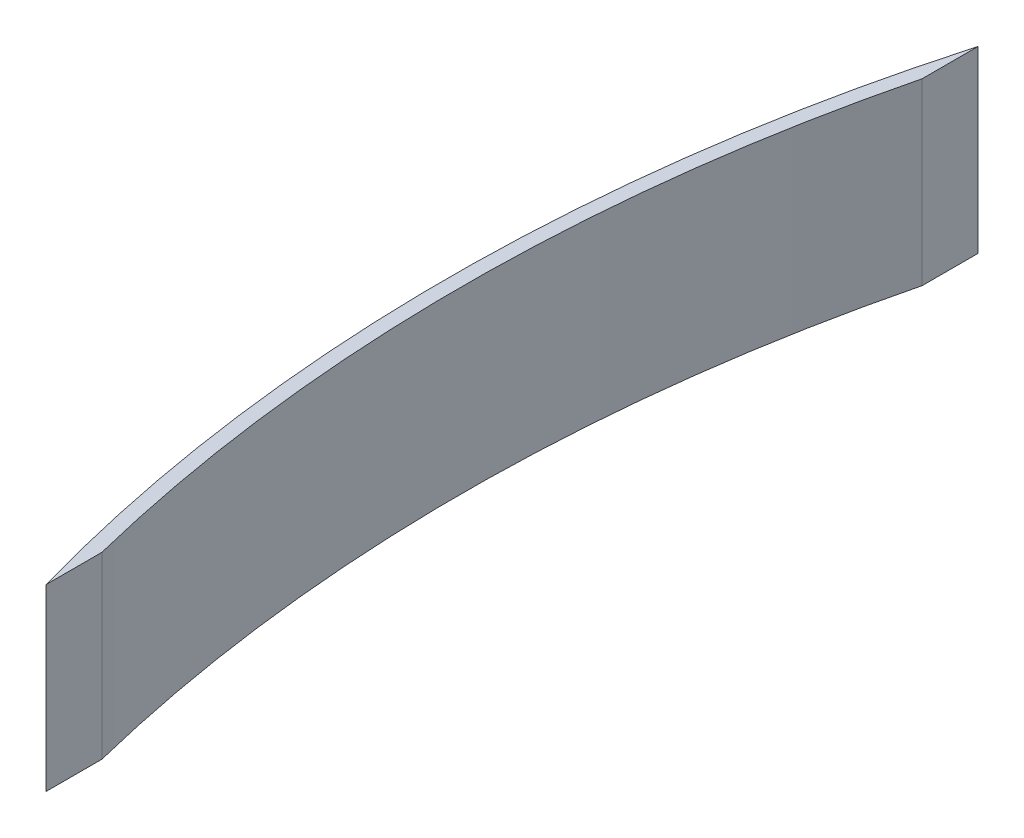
ISO-10303-21;
HEADER;
FILE_DESCRIPTION(('STEP AP214'),'2;1');
FILE_NAME('part.step','',(''),(''),'','','');
FILE_SCHEMA(('AUTOMOTIVE_DESIGN { 1 0 10303 214 1 1 1 1 }'));
ENDSEC;
DATA;
#1=APPLICATION_CONTEXT('core data for automotive mechanical design processes');
#2=APPLICATION_PROTOCOL_DEFINITION('international standard','automotive_design',2000,#1);
#3=PRODUCT_CONTEXT('',#1,'mechanical');
#4=PRODUCT('Part','Part','',(#3));
#5=PRODUCT_RELATED_PRODUCT_CATEGORY('part','',(#4));
#6=PRODUCT_DEFINITION_FORMATION('','',#4);
#7=PRODUCT_DEFINITION_CONTEXT('part definition',#1,'design');
#8=PRODUCT_DEFINITION('design','',#6,#7);
#9=PRODUCT_DEFINITION_SHAPE('','',#8);
#10=(LENGTH_UNIT() NAMED_UNIT(*) SI_UNIT(.MILLI.,.METRE.));
#11=(NAMED_UNIT(*) PLANE_ANGLE_UNIT() SI_UNIT($,.RADIAN.));
#12=(NAMED_UNIT(*) SI_UNIT($,.STERADIAN.) SOLID_ANGLE_UNIT());
#13=UNCERTAINTY_MEASURE_WITH_UNIT(LENGTH_MEASURE(1.E-05),#10,'distance_accuracy_value','');
#14=(GEOMETRIC_REPRESENTATION_CONTEXT(3) GLOBAL_UNCERTAINTY_ASSIGNED_CONTEXT((#13)) GLOBAL_UNIT_ASSIGNED_CONTEXT((#10,
#11,#12)) REPRESENTATION_CONTEXT('',''));
#15=CARTESIAN_POINT('',(0.,0.,0.));
#16=DIRECTION('',(0.,0.,1.));
#17=DIRECTION('',(1.,0.,0.));
#18=AXIS2_PLACEMENT_3D('',#15,#16,#17);
#19=CARTESIAN_POINT('',(23.0222222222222,2.5,0.));
#20=DIRECTION('',(0.,-1.,0.));
#21=DIRECTION('',(0.,0.,-1.));
#22=AXIS2_PLACEMENT_3D('',#19,#20,#21);
#23=CYLINDRICAL_SURFACE('',#22,23.9222222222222);
#24=CARTESIAN_POINT('',(23.0222222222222,0.,0.));
#25=DIRECTION('',(0.,1.,0.));
#26=DIRECTION('',(0.,0.,-1.));
#27=AXIS2_PLACEMENT_3D('',#24,#25,#26);
#28=CIRCLE('',#27,23.9222222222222);
#29=CARTESIAN_POINT('',(0.,0.,-6.5));
#30=VERTEX_POINT('',#29);
#31=CARTESIAN_POINT('',(0.,0.,6.5));
#32=VERTEX_POINT('',#31);
#33=EDGE_CURVE('E113',#30,#32,#28,.T.);
#34=ORIENTED_EDGE('',*,*,#33,.T.);
#35=DIRECTION('',(0.,-1.,0.));
#36=VECTOR('',#35,1.);
#37=CARTESIAN_POINT('',(0.,2.5,6.5));
#38=LINE('',#37,#36);
#39=CARTESIAN_POINT('',(0.,2.5,6.5));
#40=VERTEX_POINT('',#39);
#41=EDGE_CURVE('E11',#40,#32,#38,.T.);
#42=ORIENTED_EDGE('',*,*,#41,.F.);
#43=CARTESIAN_POINT('',(23.0222222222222,2.5,0.));
#44=DIRECTION('',(0.,1.,0.));
#45=DIRECTION('',(0.,0.,-1.));
#46=AXIS2_PLACEMENT_3D('',#43,#44,#45);
#47=CIRCLE('',#46,23.9222222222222);
#48=CARTESIAN_POINT('',(0.,2.5,-6.5));
#49=VERTEX_POINT('',#48);
#50=EDGE_CURVE('E97',#49,#40,#47,.T.);
#51=ORIENTED_EDGE('',*,*,#50,.F.);
#52=DIRECTION('',(0.,-1.,0.));
#53=VECTOR('',#52,1.);
#54=CARTESIAN_POINT('',(0.,2.5,-6.5));
#55=LINE('',#54,#53);
#56=EDGE_CURVE('E109',#49,#30,#55,.T.);
#57=ORIENTED_EDGE('',*,*,#56,.T.);
#58=EDGE_LOOP('',(#34,#42,#51,#57));
#59=FACE_BOUND('',#58,.T.);
#60=ADVANCED_FACE('F45',(#59),#23,.T.);
#61=CARTESIAN_POINT('',(0.,2.5,6.5));
#62=DIRECTION('',(-1.,0.,0.));
#63=DIRECTION('',(0.,0.,1.));
#64=AXIS2_PLACEMENT_3D('',#61,#62,#63);
#65=PLANE('',#64);
#66=DIRECTION('',(0.,0.,-1.));
#67=VECTOR('',#66,1.);
#68=CARTESIAN_POINT('',(0.,0.,6.5));
#69=LINE('',#68,#67);
#70=CARTESIAN_POINT('',(0.,0.,5.72023698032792));
#71=VERTEX_POINT('',#70);
#72=EDGE_CURVE('E102',#32,#71,#69,.T.);
#73=ORIENTED_EDGE('',*,*,#72,.T.);
#74=DIRECTION('',(0.,-1.,0.));
#75=VECTOR('',#74,1.);
#76=CARTESIAN_POINT('',(0.,2.5,5.72023698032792));
#77=LINE('',#76,#75);
#78=CARTESIAN_POINT('',(0.,2.5,5.72023698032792));
#79=VERTEX_POINT('',#78);
#80=EDGE_CURVE('E54',#79,#71,#77,.T.);
#81=ORIENTED_EDGE('',*,*,#80,.F.);
#82=DIRECTION('',(0.,0.,-1.));
#83=VECTOR('',#82,1.);
#84=CARTESIAN_POINT('',(0.,2.5,6.5));
#85=LINE('',#84,#83);
#86=EDGE_CURVE('E92',#40,#79,#85,.T.);
#87=ORIENTED_EDGE('',*,*,#86,.F.);
#88=ORIENTED_EDGE('',*,*,#41,.T.);
#89=EDGE_LOOP('',(#73,#81,#87,#88));
#90=FACE_BOUND('',#89,.T.);
#91=ADVANCED_FACE('F101',(#90),#65,.F.);
#92=CARTESIAN_POINT('',(23.0222222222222,2.5,0.));
#93=DIRECTION('',(0.,-1.,0.));
#94=DIRECTION('',(0.,0.,-1.));
#95=AXIS2_PLACEMENT_3D('',#92,#93,#94);
#96=CYLINDRICAL_SURFACE('',#95,23.7222222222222);
#97=CARTESIAN_POINT('',(23.0222222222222,0.,0.));
#98=DIRECTION('',(0.,-1.,0.));
#99=DIRECTION('',(0.,0.,-1.));
#100=AXIS2_PLACEMENT_3D('',#97,#98,#99);
#101=CIRCLE('',#100,23.7222222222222);
#102=CARTESIAN_POINT('',(0.,0.,-5.72023698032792));
#103=VERTEX_POINT('',#102);
#104=EDGE_CURVE('E79',#71,#103,#101,.T.);
#105=ORIENTED_EDGE('',*,*,#104,.T.);
#106=DIRECTION('',(0.,-1.,0.));
#107=VECTOR('',#106,1.);
#108=CARTESIAN_POINT('',(0.,2.5,-5.72023698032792));
#109=LINE('',#108,#107);
#110=CARTESIAN_POINT('',(0.,2.5,-5.72023698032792));
#111=VERTEX_POINT('',#110);
#112=EDGE_CURVE('E104',#111,#103,#109,.T.);
#113=ORIENTED_EDGE('',*,*,#112,.F.);
#114=CARTESIAN_POINT('',(23.0222222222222,2.5,0.));
#115=DIRECTION('',(0.,-1.,0.));
#116=DIRECTION('',(0.,0.,-1.));
#117=AXIS2_PLACEMENT_3D('',#114,#115,#116);
#118=CIRCLE('',#117,23.7222222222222);
#119=EDGE_CURVE('E95',#79,#111,#118,.T.);
#120=ORIENTED_EDGE('',*,*,#119,.F.);
#121=ORIENTED_EDGE('',*,*,#80,.T.);
#122=EDGE_LOOP('',(#105,#113,#120,#121));
#123=FACE_BOUND('',#122,.T.);
#124=ADVANCED_FACE('F105',(#123),#96,.F.);
#125=CARTESIAN_POINT('',(0.,2.5,-6.5));
#126=DIRECTION('',(-1.,0.,0.));
#127=DIRECTION('',(0.,0.,1.));
#128=AXIS2_PLACEMENT_3D('',#125,#126,#127);
#129=PLANE('',#128);
#130=DIRECTION('',(0.,0.,-1.));
#131=VECTOR('',#130,1.);
#132=CARTESIAN_POINT('',(0.,0.,-6.5));
#133=LINE('',#132,#131);
#134=EDGE_CURVE('E85',#103,#30,#133,.T.);
#135=ORIENTED_EDGE('',*,*,#134,.T.);
#136=ORIENTED_EDGE('',*,*,#56,.F.);
#137=DIRECTION('',(0.,0.,-1.));
#138=VECTOR('',#137,1.);
#139=CARTESIAN_POINT('',(0.,2.5,-6.5));
#140=LINE('',#139,#138);
#141=EDGE_CURVE('E62',#111,#49,#140,.T.);
#142=ORIENTED_EDGE('',*,*,#141,.F.);
#143=ORIENTED_EDGE('',*,*,#112,.T.);
#144=EDGE_LOOP('',(#135,#136,#142,#143));
#145=FACE_BOUND('',#144,.T.);
#146=ADVANCED_FACE('F126',(#145),#129,.F.);
#147=CARTESIAN_POINT('',(23.0222222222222,2.5,0.));
#148=DIRECTION('',(0.,-1.,0.));
#149=DIRECTION('',(0.,0.,-1.));
#150=AXIS2_PLACEMENT_3D('',#147,#148,#149);
#151=PLANE('',#150);
#152=ORIENTED_EDGE('',*,*,#50,.T.);
#153=ORIENTED_EDGE('',*,*,#86,.T.);
#154=ORIENTED_EDGE('',*,*,#119,.T.);
#155=ORIENTED_EDGE('',*,*,#141,.T.);
#156=EDGE_LOOP('',(#152,#153,#154,#155));
#157=FACE_BOUND('',#156,.T.);
#158=ADVANCED_FACE('F93',(#157),#151,.F.);
#159=CARTESIAN_POINT('',(23.0222222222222,0.,0.));
#160=DIRECTION('',(0.,-1.,0.));
#161=DIRECTION('',(0.,0.,-1.));
#162=AXIS2_PLACEMENT_3D('',#159,#160,#161);
#163=PLANE('',#162);
#164=ORIENTED_EDGE('',*,*,#33,.F.);
#165=ORIENTED_EDGE('',*,*,#134,.F.);
#166=ORIENTED_EDGE('',*,*,#104,.F.);
#167=ORIENTED_EDGE('',*,*,#72,.F.);
#168=EDGE_LOOP('',(#164,#165,#166,#167));
#169=FACE_BOUND('',#168,.T.);
#170=ADVANCED_FACE('F129',(#169),#163,.T.);
#171=CLOSED_SHELL('',(#60,#91,#124,#146,#158,#170));
#172=MANIFOLD_SOLID_BREP('B2',#171);
#173=ADVANCED_BREP_SHAPE_REPRESENTATION('',(#18,#172),#14);
#174=SHAPE_DEFINITION_REPRESENTATION(#9,#173);
ENDSEC;
END-ISO-10303-21;
